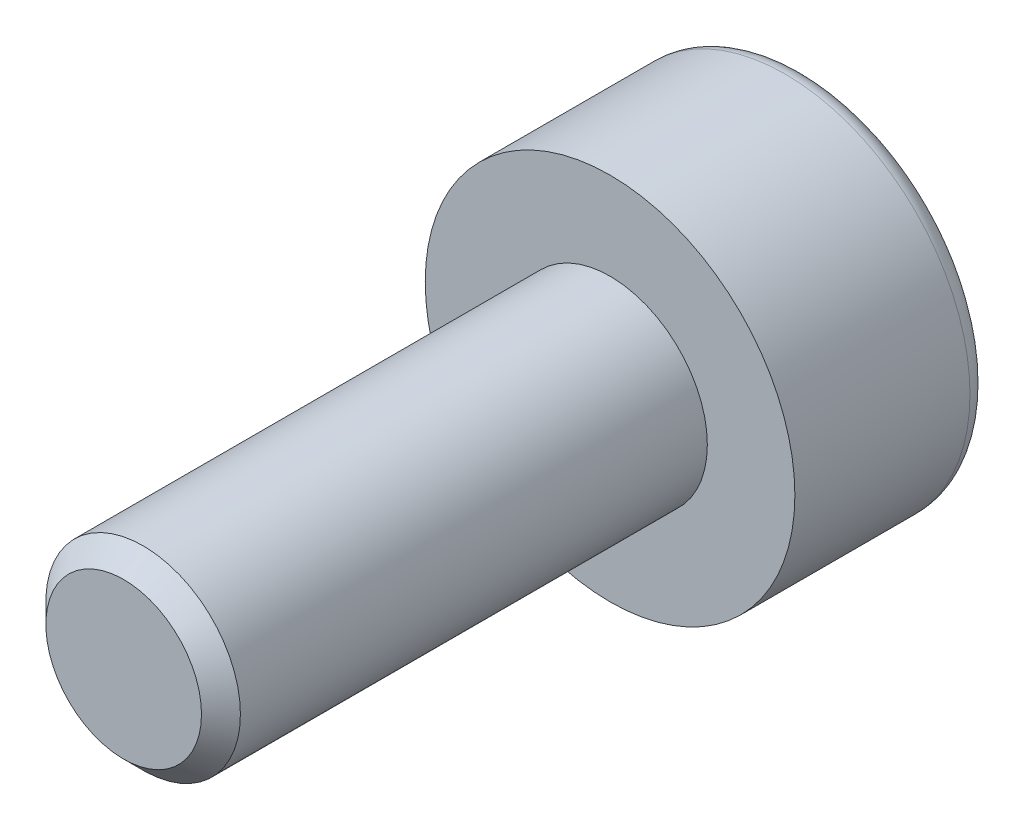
ISO-10303-21;
HEADER;
FILE_DESCRIPTION(('STEP AP214'),'2;1');
FILE_NAME('part.step','',(''),(''),'','','');
FILE_SCHEMA(('AUTOMOTIVE_DESIGN { 1 0 10303 214 1 1 1 1 }'));
ENDSEC;
DATA;
#1=APPLICATION_CONTEXT('core data for automotive mechanical design processes');
#2=APPLICATION_PROTOCOL_DEFINITION('international standard','automotive_design',2000,#1);
#3=PRODUCT_CONTEXT('',#1,'mechanical');
#4=PRODUCT('Part','Part','',(#3));
#5=PRODUCT_RELATED_PRODUCT_CATEGORY('part','',(#4));
#6=PRODUCT_DEFINITION_FORMATION('','',#4);
#7=PRODUCT_DEFINITION_CONTEXT('part definition',#1,'design');
#8=PRODUCT_DEFINITION('design','',#6,#7);
#9=PRODUCT_DEFINITION_SHAPE('','',#8);
#10=(LENGTH_UNIT() NAMED_UNIT(*) SI_UNIT(.MILLI.,.METRE.));
#11=(NAMED_UNIT(*) PLANE_ANGLE_UNIT() SI_UNIT($,.RADIAN.));
#12=(NAMED_UNIT(*) SI_UNIT($,.STERADIAN.) SOLID_ANGLE_UNIT());
#13=UNCERTAINTY_MEASURE_WITH_UNIT(LENGTH_MEASURE(1.E-05),#10,'distance_accuracy_value','');
#14=(GEOMETRIC_REPRESENTATION_CONTEXT(3) GLOBAL_UNCERTAINTY_ASSIGNED_CONTEXT((#13)) GLOBAL_UNIT_ASSIGNED_CONTEXT((#10,
#11,#12)) REPRESENTATION_CONTEXT('',''));
#15=CARTESIAN_POINT('',(0.,0.,0.));
#16=DIRECTION('',(0.,0.,1.));
#17=DIRECTION('',(1.,0.,0.));
#18=AXIS2_PLACEMENT_3D('',#15,#16,#17);
#19=CARTESIAN_POINT('',(0.,0.,-2.));
#20=DIRECTION('',(0.,0.,1.));
#21=DIRECTION('',(1.,0.,0.));
#22=AXIS2_PLACEMENT_3D('',#19,#20,#21);
#23=PLANE('',#22);
#24=CARTESIAN_POINT('',(0.,0.,-2.));
#25=DIRECTION('',(0.,0.,-1.));
#26=DIRECTION('',(-1.,0.,0.));
#27=AXIS2_PLACEMENT_3D('',#24,#25,#26);
#28=CIRCLE('',#27,1.7);
#29=CARTESIAN_POINT('',(-1.7,0.,-2.));
#30=VERTEX_POINT('',#29);
#31=EDGE_CURVE('E139',#30,#30,#28,.T.);
#32=ORIENTED_EDGE('',*,*,#31,.T.);
#33=EDGE_LOOP('',(#32));
#34=FACE_BOUND('',#33,.T.);
#35=DIRECTION('',(-0.86602540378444,0.499999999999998,0.));
#36=VECTOR('',#35,1.);
#37=CARTESIAN_POINT('',(0.,0.866025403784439,-2.));
#38=LINE('',#37,#36);
#39=CARTESIAN_POINT('',(0.75,0.433012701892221,-2.));
#40=VERTEX_POINT('',#39);
#41=CARTESIAN_POINT('',(0.,0.866025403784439,-2.));
#42=VERTEX_POINT('',#41);
#43=EDGE_CURVE('E43',#40,#42,#38,.T.);
#44=ORIENTED_EDGE('',*,*,#43,.T.);
#45=DIRECTION('',(-0.866025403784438,-0.500000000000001,0.));
#46=VECTOR('',#45,1.);
#47=CARTESIAN_POINT('',(0.,0.866025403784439,-2.));
#48=LINE('',#47,#46);
#49=CARTESIAN_POINT('',(-0.75,0.433012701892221,-2.));
#50=VERTEX_POINT('',#49);
#51=EDGE_CURVE('E83',#42,#50,#48,.T.);
#52=ORIENTED_EDGE('',*,*,#51,.T.);
#53=DIRECTION('',(0.,-1.,0.));
#54=VECTOR('',#53,1.);
#55=CARTESIAN_POINT('',(-0.75,-0.433012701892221,-2.));
#56=LINE('',#55,#54);
#57=CARTESIAN_POINT('',(-0.75,-0.433012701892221,-2.));
#58=VERTEX_POINT('',#57);
#59=EDGE_CURVE('E91',#50,#58,#56,.T.);
#60=ORIENTED_EDGE('',*,*,#59,.T.);
#61=DIRECTION('',(0.866025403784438,-0.500000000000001,0.));
#62=VECTOR('',#61,1.);
#63=CARTESIAN_POINT('',(0.,-0.866025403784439,-2.));
#64=LINE('',#63,#62);
#65=CARTESIAN_POINT('',(0.,-0.866025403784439,-2.));
#66=VERTEX_POINT('',#65);
#67=EDGE_CURVE('E109',#58,#66,#64,.T.);
#68=ORIENTED_EDGE('',*,*,#67,.T.);
#69=DIRECTION('',(0.86602540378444,0.499999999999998,0.));
#70=VECTOR('',#69,1.);
#71=CARTESIAN_POINT('',(0.,-0.866025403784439,-2.));
#72=LINE('',#71,#70);
#73=CARTESIAN_POINT('',(0.75,-0.433012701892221,-2.));
#74=VERTEX_POINT('',#73);
#75=EDGE_CURVE('E112',#66,#74,#72,.T.);
#76=ORIENTED_EDGE('',*,*,#75,.T.);
#77=DIRECTION('',(0.,1.,0.));
#78=VECTOR('',#77,1.);
#79=CARTESIAN_POINT('',(0.75,-0.433012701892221,-2.));
#80=LINE('',#79,#78);
#81=EDGE_CURVE('E102',#74,#40,#80,.T.);
#82=ORIENTED_EDGE('',*,*,#81,.T.);
#83=EDGE_LOOP('',(#44,#52,#60,#68,#76,#82));
#84=FACE_BOUND('',#83,.T.);
#85=ADVANCED_FACE('F29',(#34,#84),#23,.F.);
#86=CARTESIAN_POINT('',(0.,0.,-1.8));
#87=DIRECTION('',(0.,0.,-1.));
#88=DIRECTION('',(-1.,0.,0.));
#89=AXIS2_PLACEMENT_3D('',#86,#87,#88);
#90=TOROIDAL_SURFACE('',#89,1.7,0.2);
#91=ORIENTED_EDGE('',*,*,#31,.F.);
#92=EDGE_LOOP('',(#91));
#93=FACE_BOUND('',#92,.T.);
#94=CARTESIAN_POINT('',(0.,0.,-1.8));
#95=DIRECTION('',(0.,0.,-1.));
#96=DIRECTION('',(-1.,0.,0.));
#97=AXIS2_PLACEMENT_3D('',#94,#95,#96);
#98=CIRCLE('',#97,1.9);
#99=CARTESIAN_POINT('',(-1.9,0.,-1.8));
#100=VERTEX_POINT('',#99);
#101=EDGE_CURVE('E136',#100,#100,#98,.T.);
#102=ORIENTED_EDGE('',*,*,#101,.T.);
#103=EDGE_LOOP('',(#102));
#104=FACE_BOUND('',#103,.T.);
#105=ADVANCED_FACE('F158',(#93,#104),#90,.T.);
#106=CARTESIAN_POINT('',(0.,0.,0.));
#107=DIRECTION('',(0.,0.,-1.));
#108=DIRECTION('',(-1.,0.,0.));
#109=AXIS2_PLACEMENT_3D('',#106,#107,#108);
#110=CYLINDRICAL_SURFACE('',#109,1.9);
#111=ORIENTED_EDGE('',*,*,#101,.F.);
#112=EDGE_LOOP('',(#111));
#113=FACE_BOUND('',#112,.T.);
#114=CARTESIAN_POINT('',(0.,0.,0.));
#115=DIRECTION('',(0.,0.,-1.));
#116=DIRECTION('',(-1.,0.,0.));
#117=AXIS2_PLACEMENT_3D('',#114,#115,#116);
#118=CIRCLE('',#117,1.9);
#119=CARTESIAN_POINT('',(-1.9,0.,0.));
#120=VERTEX_POINT('',#119);
#121=EDGE_CURVE('E97',#120,#120,#118,.T.);
#122=ORIENTED_EDGE('',*,*,#121,.T.);
#123=EDGE_LOOP('',(#122));
#124=FACE_BOUND('',#123,.T.);
#125=ADVANCED_FACE('F163',(#113,#124),#110,.T.);
#126=CARTESIAN_POINT('',(0.,0.,0.));
#127=DIRECTION('',(0.,0.,-1.));
#128=DIRECTION('',(-1.,0.,0.));
#129=AXIS2_PLACEMENT_3D('',#126,#127,#128);
#130=PLANE('',#129);
#131=CARTESIAN_POINT('',(0.,0.,0.));
#132=DIRECTION('',(0.,0.,1.));
#133=DIRECTION('',(1.,0.,0.));
#134=AXIS2_PLACEMENT_3D('',#131,#132,#133);
#135=CIRCLE('',#134,1.);
#136=CARTESIAN_POINT('',(1.,0.,0.));
#137=VERTEX_POINT('',#136);
#138=EDGE_CURVE('E103',#137,#137,#135,.T.);
#139=ORIENTED_EDGE('',*,*,#138,.F.);
#140=EDGE_LOOP('',(#139));
#141=FACE_BOUND('',#140,.T.);
#142=ORIENTED_EDGE('',*,*,#121,.F.);
#143=EDGE_LOOP('',(#142));
#144=FACE_BOUND('',#143,.T.);
#145=ADVANCED_FACE('F171',(#141,#144),#130,.F.);
#146=CARTESIAN_POINT('',(0.,0.866025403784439,-1.));
#147=DIRECTION('',(-0.499999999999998,-0.86602540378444,0.));
#148=DIRECTION('',(0.86602540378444,-0.499999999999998,0.));
#149=AXIS2_PLACEMENT_3D('',#146,#147,#148);
#150=PLANE('',#149);
#151=ORIENTED_EDGE('',*,*,#43,.F.);
#152=DIRECTION('',(0.,0.,-1.));
#153=VECTOR('',#152,1.);
#154=CARTESIAN_POINT('',(0.75,0.433012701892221,-1.));
#155=LINE('',#154,#153);
#156=CARTESIAN_POINT('',(0.75,0.433012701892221,-1.));
#157=VERTEX_POINT('',#156);
#158=EDGE_CURVE('E125',#157,#40,#155,.T.);
#159=ORIENTED_EDGE('',*,*,#158,.F.);
#160=DIRECTION('',(-0.86602540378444,0.499999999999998,0.));
#161=VECTOR('',#160,1.);
#162=CARTESIAN_POINT('',(0.,0.866025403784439,-1.));
#163=LINE('',#162,#161);
#164=CARTESIAN_POINT('',(0.,0.866025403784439,-1.));
#165=VERTEX_POINT('',#164);
#166=EDGE_CURVE('E96',#157,#165,#163,.T.);
#167=ORIENTED_EDGE('',*,*,#166,.T.);
#168=DIRECTION('',(0.,0.,-1.));
#169=VECTOR('',#168,1.);
#170=CARTESIAN_POINT('',(0.,0.866025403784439,-1.));
#171=LINE('',#170,#169);
#172=EDGE_CURVE('E85',#165,#42,#171,.T.);
#173=ORIENTED_EDGE('',*,*,#172,.T.);
#174=EDGE_LOOP('',(#151,#159,#167,#173));
#175=FACE_BOUND('',#174,.T.);
#176=ADVANCED_FACE('F94',(#175),#150,.T.);
#177=CARTESIAN_POINT('',(0.,0.866025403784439,-1.));
#178=DIRECTION('',(0.500000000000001,-0.866025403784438,0.));
#179=DIRECTION('',(0.866025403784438,0.500000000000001,0.));
#180=AXIS2_PLACEMENT_3D('',#177,#178,#179);
#181=PLANE('',#180);
#182=ORIENTED_EDGE('',*,*,#51,.F.);
#183=ORIENTED_EDGE('',*,*,#172,.F.);
#184=DIRECTION('',(-0.866025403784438,-0.500000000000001,0.));
#185=VECTOR('',#184,1.);
#186=CARTESIAN_POINT('',(0.,0.866025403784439,-1.));
#187=LINE('',#186,#185);
#188=CARTESIAN_POINT('',(-0.75,0.433012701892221,-1.));
#189=VERTEX_POINT('',#188);
#190=EDGE_CURVE('E116',#165,#189,#187,.T.);
#191=ORIENTED_EDGE('',*,*,#190,.T.);
#192=DIRECTION('',(0.,0.,-1.));
#193=VECTOR('',#192,1.);
#194=CARTESIAN_POINT('',(-0.75,0.433012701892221,-1.));
#195=LINE('',#194,#193);
#196=EDGE_CURVE('E87',#189,#50,#195,.T.);
#197=ORIENTED_EDGE('',*,*,#196,.T.);
#198=EDGE_LOOP('',(#182,#183,#191,#197));
#199=FACE_BOUND('',#198,.T.);
#200=ADVANCED_FACE('F84',(#199),#181,.T.);
#201=CARTESIAN_POINT('',(-0.75,-0.433012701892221,-1.));
#202=DIRECTION('',(1.,0.,0.));
#203=DIRECTION('',(0.,0.,-1.));
#204=AXIS2_PLACEMENT_3D('',#201,#202,#203);
#205=PLANE('',#204);
#206=ORIENTED_EDGE('',*,*,#59,.F.);
#207=ORIENTED_EDGE('',*,*,#196,.F.);
#208=DIRECTION('',(0.,-1.,0.));
#209=VECTOR('',#208,1.);
#210=CARTESIAN_POINT('',(-0.75,-0.433012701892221,-1.));
#211=LINE('',#210,#209);
#212=CARTESIAN_POINT('',(-0.75,-0.433012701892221,-1.));
#213=VERTEX_POINT('',#212);
#214=EDGE_CURVE('E118',#189,#213,#211,.T.);
#215=ORIENTED_EDGE('',*,*,#214,.T.);
#216=DIRECTION('',(0.,0.,-1.));
#217=VECTOR('',#216,1.);
#218=CARTESIAN_POINT('',(-0.75,-0.433012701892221,-1.));
#219=LINE('',#218,#217);
#220=EDGE_CURVE('E131',#213,#58,#219,.T.);
#221=ORIENTED_EDGE('',*,*,#220,.T.);
#222=EDGE_LOOP('',(#206,#207,#215,#221));
#223=FACE_BOUND('',#222,.T.);
#224=ADVANCED_FACE('F186',(#223),#205,.T.);
#225=CARTESIAN_POINT('',(0.,-0.866025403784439,-1.));
#226=DIRECTION('',(0.500000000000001,0.866025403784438,0.));
#227=DIRECTION('',(-0.866025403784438,0.500000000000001,0.));
#228=AXIS2_PLACEMENT_3D('',#225,#226,#227);
#229=PLANE('',#228);
#230=ORIENTED_EDGE('',*,*,#67,.F.);
#231=ORIENTED_EDGE('',*,*,#220,.F.);
#232=DIRECTION('',(0.866025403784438,-0.500000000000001,0.));
#233=VECTOR('',#232,1.);
#234=CARTESIAN_POINT('',(0.,-0.866025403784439,-1.));
#235=LINE('',#234,#233);
#236=CARTESIAN_POINT('',(0.,-0.866025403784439,-1.));
#237=VERTEX_POINT('',#236);
#238=EDGE_CURVE('E120',#213,#237,#235,.T.);
#239=ORIENTED_EDGE('',*,*,#238,.T.);
#240=DIRECTION('',(0.,0.,-1.));
#241=VECTOR('',#240,1.);
#242=CARTESIAN_POINT('',(0.,-0.866025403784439,-1.));
#243=LINE('',#242,#241);
#244=EDGE_CURVE('E129',#237,#66,#243,.T.);
#245=ORIENTED_EDGE('',*,*,#244,.T.);
#246=EDGE_LOOP('',(#230,#231,#239,#245));
#247=FACE_BOUND('',#246,.T.);
#248=ADVANCED_FACE('F189',(#247),#229,.T.);
#249=CARTESIAN_POINT('',(0.,-0.866025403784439,-1.));
#250=DIRECTION('',(-0.499999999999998,0.86602540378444,0.));
#251=DIRECTION('',(-0.86602540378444,-0.499999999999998,0.));
#252=AXIS2_PLACEMENT_3D('',#249,#250,#251);
#253=PLANE('',#252);
#254=ORIENTED_EDGE('',*,*,#75,.F.);
#255=ORIENTED_EDGE('',*,*,#244,.F.);
#256=DIRECTION('',(0.86602540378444,0.499999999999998,0.));
#257=VECTOR('',#256,1.);
#258=CARTESIAN_POINT('',(0.,-0.866025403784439,-1.));
#259=LINE('',#258,#257);
#260=CARTESIAN_POINT('',(0.75,-0.433012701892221,-1.));
#261=VERTEX_POINT('',#260);
#262=EDGE_CURVE('E122',#237,#261,#259,.T.);
#263=ORIENTED_EDGE('',*,*,#262,.T.);
#264=DIRECTION('',(0.,0.,-1.));
#265=VECTOR('',#264,1.);
#266=CARTESIAN_POINT('',(0.75,-0.433012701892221,-1.));
#267=LINE('',#266,#265);
#268=EDGE_CURVE('E127',#261,#74,#267,.T.);
#269=ORIENTED_EDGE('',*,*,#268,.T.);
#270=EDGE_LOOP('',(#254,#255,#263,#269));
#271=FACE_BOUND('',#270,.T.);
#272=ADVANCED_FACE('F193',(#271),#253,.T.);
#273=CARTESIAN_POINT('',(0.75,-0.433012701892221,-1.));
#274=DIRECTION('',(-1.,0.,0.));
#275=DIRECTION('',(0.,0.,1.));
#276=AXIS2_PLACEMENT_3D('',#273,#274,#275);
#277=PLANE('',#276);
#278=ORIENTED_EDGE('',*,*,#81,.F.);
#279=ORIENTED_EDGE('',*,*,#268,.F.);
#280=DIRECTION('',(0.,1.,0.));
#281=VECTOR('',#280,1.);
#282=CARTESIAN_POINT('',(0.75,-0.433012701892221,-1.));
#283=LINE('',#282,#281);
#284=EDGE_CURVE('E50',#261,#157,#283,.T.);
#285=ORIENTED_EDGE('',*,*,#284,.T.);
#286=ORIENTED_EDGE('',*,*,#158,.T.);
#287=EDGE_LOOP('',(#278,#279,#285,#286));
#288=FACE_BOUND('',#287,.T.);
#289=ADVANCED_FACE('F197',(#288),#277,.T.);
#290=CARTESIAN_POINT('',(0.75,0.433012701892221,-1.));
#291=DIRECTION('',(0.,0.,1.));
#292=DIRECTION('',(1.,0.,0.));
#293=AXIS2_PLACEMENT_3D('',#290,#291,#292);
#294=PLANE('',#293);
#295=ORIENTED_EDGE('',*,*,#166,.F.);
#296=ORIENTED_EDGE('',*,*,#284,.F.);
#297=ORIENTED_EDGE('',*,*,#262,.F.);
#298=ORIENTED_EDGE('',*,*,#238,.F.);
#299=ORIENTED_EDGE('',*,*,#214,.F.);
#300=ORIENTED_EDGE('',*,*,#190,.F.);
#301=EDGE_LOOP('',(#295,#296,#297,#298,#299,#300));
#302=FACE_BOUND('',#301,.T.);
#303=ADVANCED_FACE('F201',(#302),#294,.F.);
#304=CARTESIAN_POINT('',(0.,0.,5.));
#305=DIRECTION('',(0.,0.,1.));
#306=DIRECTION('',(1.,0.,0.));
#307=AXIS2_PLACEMENT_3D('',#304,#305,#306);
#308=PLANE('',#307);
#309=CARTESIAN_POINT('',(0.,0.,5.));
#310=DIRECTION('',(0.,0.,1.));
#311=DIRECTION('',(1.,0.,0.));
#312=AXIS2_PLACEMENT_3D('',#309,#310,#311);
#313=CIRCLE('',#312,0.8);
#314=CARTESIAN_POINT('',(0.800000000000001,0.,5.));
#315=VERTEX_POINT('',#314);
#316=EDGE_CURVE('E36',#315,#315,#313,.T.);
#317=ORIENTED_EDGE('',*,*,#316,.T.);
#318=EDGE_LOOP('',(#317));
#319=FACE_BOUND('',#318,.T.);
#320=ADVANCED_FACE('F144',(#319),#308,.T.);
#321=CARTESIAN_POINT('',(0.,0.,0.));
#322=DIRECTION('',(0.,0.,1.));
#323=DIRECTION('',(1.,0.,0.));
#324=AXIS2_PLACEMENT_3D('',#321,#322,#323);
#325=CYLINDRICAL_SURFACE('',#324,1.);
#326=CARTESIAN_POINT('',(0.,0.,4.8));
#327=DIRECTION('',(0.,0.,1.));
#328=DIRECTION('',(1.,0.,0.));
#329=AXIS2_PLACEMENT_3D('',#326,#327,#328);
#330=CIRCLE('',#329,1.);
#331=CARTESIAN_POINT('',(1.,0.,4.8));
#332=VERTEX_POINT('',#331);
#333=EDGE_CURVE('E11',#332,#332,#330,.F.);
#334=ORIENTED_EDGE('',*,*,#333,.T.);
#335=EDGE_LOOP('',(#334));
#336=FACE_BOUND('',#335,.T.);
#337=ORIENTED_EDGE('',*,*,#138,.T.);
#338=EDGE_LOOP('',(#337));
#339=FACE_BOUND('',#338,.T.);
#340=ADVANCED_FACE('F148',(#336,#339),#325,.T.);
#341=CARTESIAN_POINT('',(0.,0.,5.));
#342=DIRECTION('',(0.,0.,-1.));
#343=DIRECTION('',(-1.,0.,0.));
#344=AXIS2_PLACEMENT_3D('',#341,#342,#343);
#345=CONICAL_SURFACE('',#344,0.8,0.785398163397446);
#346=ORIENTED_EDGE('',*,*,#333,.F.);
#347=EDGE_LOOP('',(#346));
#348=FACE_BOUND('',#347,.T.);
#349=ORIENTED_EDGE('',*,*,#316,.F.);
#350=EDGE_LOOP('',(#349));
#351=FACE_BOUND('',#350,.T.);
#352=ADVANCED_FACE('F146',(#348,#351),#345,.T.);
#353=CLOSED_SHELL('',(#85,#105,#125,#145,#176,#200,#224,#248,#272,#289,#303,#320,#340,#352));
#354=MANIFOLD_SOLID_BREP('B2',#353);
#355=ADVANCED_BREP_SHAPE_REPRESENTATION('',(#18,#354),#14);
#356=SHAPE_DEFINITION_REPRESENTATION(#9,#355);
ENDSEC;
END-ISO-10303-21;
